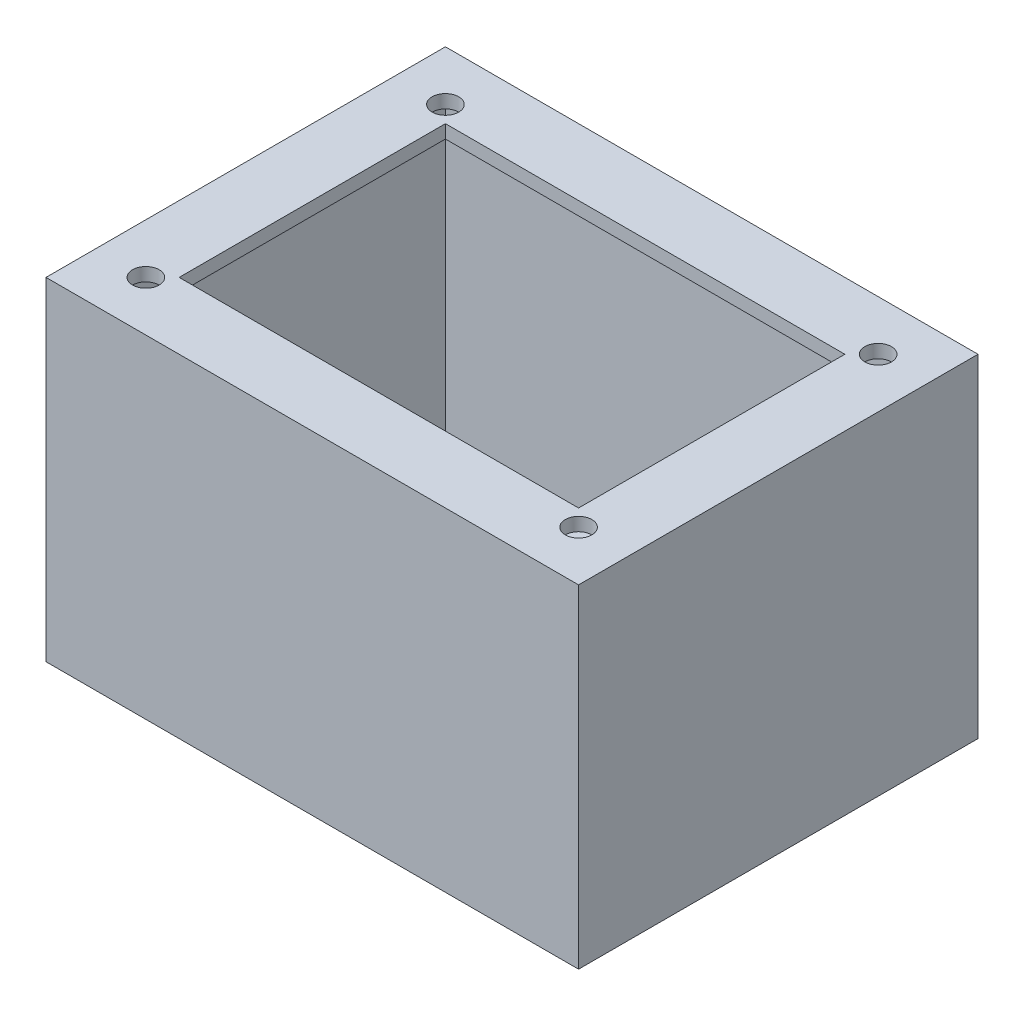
from build123d import *

# Parameters (mm, degrees)
SKETCH1_W               = 101.6
SKETCH1_H               = 76.2
BOSS_EXTRUDE1_DEPTH     = 63.5
SHELL1_T                = -6.35
SKETCH2_W               = 88.9
SKETCH2_H               = 63.5
SKETCH2_W_2             = 76.2
SKETCH2_H_2             = 50.8
BOSS_EXTRUDE2_DEPTH     = 2.54
CUT_EXTRUDE1_REACH      = 91.803
SKETCH3_R               = 2.54
MIRROR2_COPY_1_REACH    = 91.803
MIRROR2_COPY_1_SKETCH_R = 2.54


with BuildPart() as part:
    # Sketch1 → Boss-Extrude1 (new body)
    with BuildSketch(Plane(origin=(0, 0, 0), x_dir=(1, 0, 0), z_dir=(0, 1, 0))):
        Rectangle(SKETCH1_W, SKETCH1_H)
    extrude(amount=BOSS_EXTRUDE1_DEPTH)

    # Shell1
    shell1_openings = [part.faces().sort_by_distance(p)[0] for p in [
        (0, 63.5, 0),
    ]]
    offset(amount=SHELL1_T, openings=shell1_openings, kind=Kind.INTERSECTION)

    # Sketch2 → Boss-Extrude2 (add)
    with BuildSketch(Plane(origin=(0, 63.5, 0), x_dir=(1, 0, 0), z_dir=(0, 1, 0))):
        Rectangle(SKETCH2_W, SKETCH2_H)
        Rectangle(SKETCH2_W_2, SKETCH2_H_2, mode=Mode.SUBTRACT)
    extrude(amount=-BOSS_EXTRUDE2_DEPTH)

    # Sketch3 → Cut-Extrude1 (cut, up to next)
    with BuildSketch(Plane(origin=(0, 63.5, 0), x_dir=(1, 0, 0), z_dir=(0, 1, 0)), mode=Mode.PRIVATE) as cut_extrude1_sk1:
        with Locations(Location((-41.275, 28.575, 0), (0, 0, 270))):
            Circle(SKETCH3_R)
    cut_extrude1_tool1 = extrude(cut_extrude1_sk1.sketch, amount=-CUT_EXTRUDE1_REACH, mode=Mode.PRIVATE) & part.part
    cut_extrude1 = cut_extrude1_tool1.solids().sort_by_distance((-41.275, 63.5, -28.575))[0]
    add(cut_extrude1, mode=Mode.SUBTRACT)

    # Mirror1: Cut-Extrude1 across plane
    add(cut_extrude1.mirror(Plane.XY), mode=Mode.SUBTRACT)

    # Mirror2: Cut-Extrude1 across plane
    add(cut_extrude1.mirror(Plane(origin=(0, 0, 0), x_dir=(0, 0, 1), z_dir=(1, 0, 0))), mode=Mode.SUBTRACT)

    # Mirror2 copy 1 sketch → Mirror2 copy 1 (cut, up to next)
    with BuildSketch(Plane(origin=(0, 63.5, 0), x_dir=(-1, 0, 0), z_dir=(0, 1, 0)), mode=Mode.PRIVATE) as mirror2_copy_1_sk1:
        with Locations(Location((-41.275, 28.575, 0), (0, 0, 270))):
            Circle(MIRROR2_COPY_1_SKETCH_R)
    mirror2_copy_1_tool1 = extrude(mirror2_copy_1_sk1.sketch, amount=-MIRROR2_COPY_1_REACH, mode=Mode.PRIVATE) & part.part
    add(mirror2_copy_1_tool1.solids().sort_by_distance((41.275, 63.5, 28.575))[0], mode=Mode.SUBTRACT)


solid = part.part
